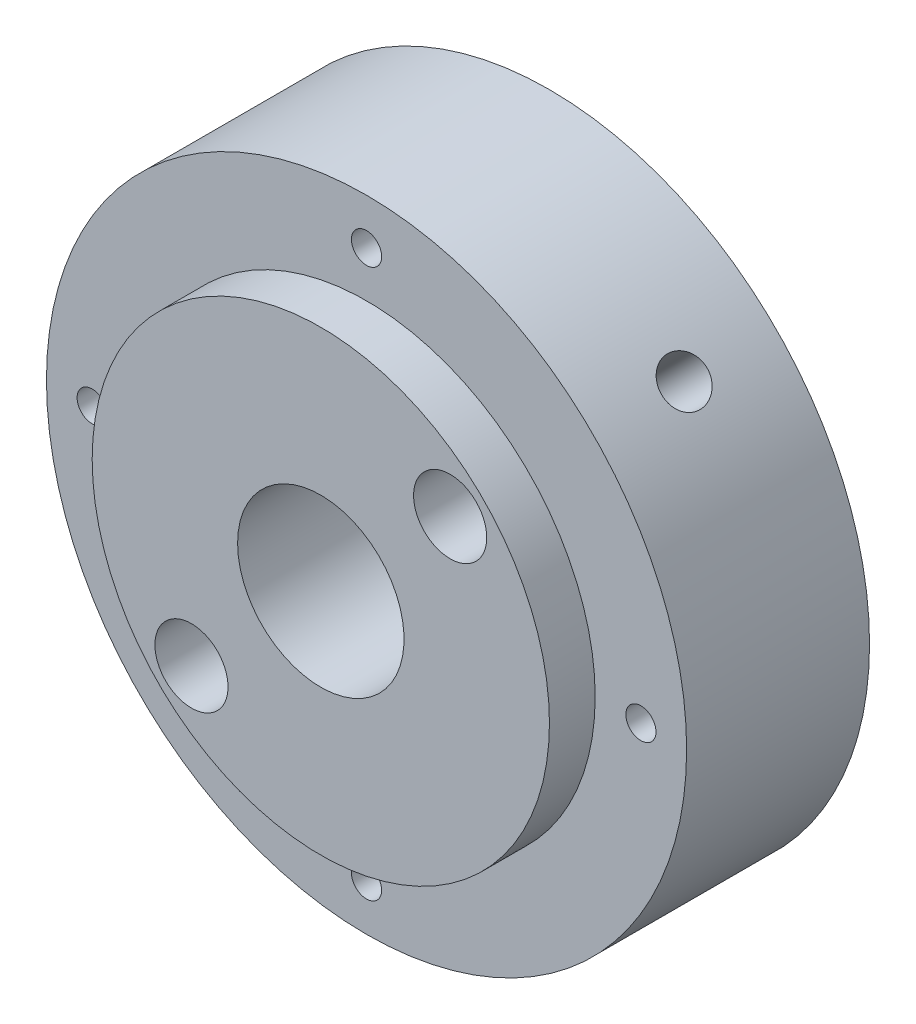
ISO-10303-21;
HEADER;
FILE_DESCRIPTION(('STEP AP214'),'2;1');
FILE_NAME('part.step','',(''),(''),'','','');
FILE_SCHEMA(('AUTOMOTIVE_DESIGN { 1 0 10303 214 1 1 1 1 }'));
ENDSEC;
DATA;
#1=APPLICATION_CONTEXT('core data for automotive mechanical design processes');
#2=APPLICATION_PROTOCOL_DEFINITION('international standard','automotive_design',2000,#1);
#3=PRODUCT_CONTEXT('',#1,'mechanical');
#4=PRODUCT('Part','Part','',(#3));
#5=PRODUCT_RELATED_PRODUCT_CATEGORY('part','',(#4));
#6=PRODUCT_DEFINITION_FORMATION('','',#4);
#7=PRODUCT_DEFINITION_CONTEXT('part definition',#1,'design');
#8=PRODUCT_DEFINITION('design','',#6,#7);
#9=PRODUCT_DEFINITION_SHAPE('','',#8);
#10=(LENGTH_UNIT() NAMED_UNIT(*) SI_UNIT(.MILLI.,.METRE.));
#11=(NAMED_UNIT(*) PLANE_ANGLE_UNIT() SI_UNIT($,.RADIAN.));
#12=(NAMED_UNIT(*) SI_UNIT($,.STERADIAN.) SOLID_ANGLE_UNIT());
#13=UNCERTAINTY_MEASURE_WITH_UNIT(LENGTH_MEASURE(1.E-05),#10,'distance_accuracy_value','');
#14=(GEOMETRIC_REPRESENTATION_CONTEXT(3) GLOBAL_UNCERTAINTY_ASSIGNED_CONTEXT((#13)) GLOBAL_UNIT_ASSIGNED_CONTEXT((#10,
#11,#12)) REPRESENTATION_CONTEXT('',''));
#15=CARTESIAN_POINT('',(0.,0.,0.));
#16=DIRECTION('',(0.,0.,1.));
#17=DIRECTION('',(1.,0.,0.));
#18=AXIS2_PLACEMENT_3D('',#15,#16,#17);
#19=CARTESIAN_POINT('',(1.45519152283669E-11,0.,20.));
#20=DIRECTION('',(0.,0.,1.));
#21=DIRECTION('',(1.,0.,0.));
#22=AXIS2_PLACEMENT_3D('',#19,#20,#21);
#23=PLANE('',#22);
#24=CARTESIAN_POINT('',(-30.,0.,20.));
#25=DIRECTION('',(0.,0.,1.));
#26=DIRECTION('',(1.,0.,0.));
#27=AXIS2_PLACEMENT_3D('',#24,#25,#26);
#28=CIRCLE('',#27,1.65);
#29=CARTESIAN_POINT('',(-28.35,0.,20.));
#30=VERTEX_POINT('',#29);
#31=EDGE_CURVE('E66',#30,#30,#28,.T.);
#32=ORIENTED_EDGE('',*,*,#31,.F.);
#33=EDGE_LOOP('',(#32));
#34=FACE_BOUND('',#33,.T.);
#35=CARTESIAN_POINT('',(3.63797880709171E-12,-30.,20.));
#36=DIRECTION('',(0.,0.,1.));
#37=DIRECTION('',(1.,0.,0.));
#38=AXIS2_PLACEMENT_3D('',#35,#36,#37);
#39=CIRCLE('',#38,1.65);
#40=CARTESIAN_POINT('',(1.65000000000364,-30.,20.));
#41=VERTEX_POINT('',#40);
#42=EDGE_CURVE('E62',#41,#41,#39,.T.);
#43=ORIENTED_EDGE('',*,*,#42,.F.);
#44=EDGE_LOOP('',(#43));
#45=FACE_BOUND('',#44,.T.);
#46=CARTESIAN_POINT('',(30.0000000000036,0.,20.));
#47=DIRECTION('',(0.,0.,1.));
#48=DIRECTION('',(1.,0.,0.));
#49=AXIS2_PLACEMENT_3D('',#46,#47,#48);
#50=CIRCLE('',#49,1.65);
#51=CARTESIAN_POINT('',(31.6500000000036,0.,20.));
#52=VERTEX_POINT('',#51);
#53=EDGE_CURVE('E58',#52,#52,#50,.T.);
#54=ORIENTED_EDGE('',*,*,#53,.F.);
#55=EDGE_LOOP('',(#54));
#56=FACE_BOUND('',#55,.T.);
#57=CARTESIAN_POINT('',(3.63797880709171E-12,29.9999999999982,20.));
#58=DIRECTION('',(0.,0.,1.));
#59=DIRECTION('',(1.,0.,0.));
#60=AXIS2_PLACEMENT_3D('',#57,#58,#59);
#61=CIRCLE('',#60,1.65);
#62=CARTESIAN_POINT('',(1.65000000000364,29.9999999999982,20.));
#63=VERTEX_POINT('',#62);
#64=EDGE_CURVE('E53',#63,#63,#61,.T.);
#65=ORIENTED_EDGE('',*,*,#64,.F.);
#66=EDGE_LOOP('',(#65));
#67=FACE_BOUND('',#66,.T.);
#68=CARTESIAN_POINT('',(1.45519152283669E-11,0.,20.));
#69=DIRECTION('',(0.,0.,1.));
#70=DIRECTION('',(1.,0.,0.));
#71=AXIS2_PLACEMENT_3D('',#68,#69,#70);
#72=CIRCLE('',#71,34.9999999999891);
#73=CARTESIAN_POINT('',(35.0000000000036,0.,20.));
#74=VERTEX_POINT('',#73);
#75=EDGE_CURVE('E10',#74,#74,#72,.T.);
#76=ORIENTED_EDGE('',*,*,#75,.T.);
#77=EDGE_LOOP('',(#76));
#78=FACE_BOUND('',#77,.T.);
#79=CARTESIAN_POINT('',(0.,0.,20.));
#80=DIRECTION('',(0.,0.,1.));
#81=DIRECTION('',(1.,0.,0.));
#82=AXIS2_PLACEMENT_3D('',#79,#80,#81);
#83=CIRCLE('',#82,25.);
#84=CARTESIAN_POINT('',(25.,0.,20.));
#85=VERTEX_POINT('',#84);
#86=EDGE_CURVE('E114',#85,#85,#83,.T.);
#87=ORIENTED_EDGE('',*,*,#86,.F.);
#88=EDGE_LOOP('',(#87));
#89=FACE_BOUND('',#88,.T.);
#90=ADVANCED_FACE('F30',(#34,#45,#56,#67,#78,#89),#23,.T.);
#91=CARTESIAN_POINT('',(1.45519152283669E-11,0.,0.));
#92=DIRECTION('',(0.,0.,1.));
#93=DIRECTION('',(1.,0.,0.));
#94=AXIS2_PLACEMENT_3D('',#91,#92,#93);
#95=PLANE('',#94);
#96=CARTESIAN_POINT('',(-14.1421356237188,-14.1421356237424,0.));
#97=DIRECTION('',(0.,0.,1.));
#98=DIRECTION('',(1.,0.,0.));
#99=AXIS2_PLACEMENT_3D('',#96,#97,#98);
#100=CIRCLE('',#99,4.);
#101=CARTESIAN_POINT('',(-10.1421356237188,-14.1421356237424,0.));
#102=VERTEX_POINT('',#101);
#103=EDGE_CURVE('E122',#102,#102,#100,.T.);
#104=ORIENTED_EDGE('',*,*,#103,.T.);
#105=EDGE_LOOP('',(#104));
#106=FACE_BOUND('',#105,.T.);
#107=CARTESIAN_POINT('',(1.45519152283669E-11,0.,0.));
#108=DIRECTION('',(0.,0.,1.));
#109=DIRECTION('',(1.,0.,0.));
#110=AXIS2_PLACEMENT_3D('',#107,#108,#109);
#111=CIRCLE('',#110,34.9999999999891);
#112=CARTESIAN_POINT('',(35.0000000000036,0.,0.));
#113=VERTEX_POINT('',#112);
#114=EDGE_CURVE('E43',#113,#113,#111,.T.);
#115=ORIENTED_EDGE('',*,*,#114,.F.);
#116=EDGE_LOOP('',(#115));
#117=FACE_BOUND('',#116,.T.);
#118=CARTESIAN_POINT('',(1.45519152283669E-11,0.,0.));
#119=DIRECTION('',(0.,0.,1.));
#120=DIRECTION('',(1.,0.,0.));
#121=AXIS2_PLACEMENT_3D('',#118,#119,#120);
#122=CIRCLE('',#121,9.1);
#123=CARTESIAN_POINT('',(9.10000000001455,0.,0.));
#124=VERTEX_POINT('',#123);
#125=EDGE_CURVE('E48',#124,#124,#122,.T.);
#126=ORIENTED_EDGE('',*,*,#125,.T.);
#127=EDGE_LOOP('',(#126));
#128=FACE_BOUND('',#127,.T.);
#129=CARTESIAN_POINT('',(14.142135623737,14.1421356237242,0.));
#130=DIRECTION('',(0.,0.,1.));
#131=DIRECTION('',(1.,0.,0.));
#132=AXIS2_PLACEMENT_3D('',#129,#130,#131);
#133=CIRCLE('',#132,4.);
#134=CARTESIAN_POINT('',(18.142135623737,14.1421356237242,0.));
#135=VERTEX_POINT('',#134);
#136=EDGE_CURVE('E118',#135,#135,#133,.T.);
#137=ORIENTED_EDGE('',*,*,#136,.T.);
#138=EDGE_LOOP('',(#137));
#139=FACE_BOUND('',#138,.T.);
#140=ADVANCED_FACE('F129',(#106,#117,#128,#139),#95,.F.);
#141=CARTESIAN_POINT('',(1.45519152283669E-11,0.,20.));
#142=DIRECTION('',(0.,0.,-1.));
#143=DIRECTION('',(-1.,0.,0.));
#144=AXIS2_PLACEMENT_3D('',#141,#142,#143);
#145=CYLINDRICAL_SURFACE('',#144,34.9999999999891);
#146=CARTESIAN_POINT('',(22.917755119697,26.4532890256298,10.));
#147=CARTESIAN_POINT('',(22.9177603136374,26.4532855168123,9.85976621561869));
#148=CARTESIAN_POINT('',(22.9267304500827,26.4455215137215,9.71943531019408));
#149=CARTESIAN_POINT('',(22.962334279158,26.4146122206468,9.44265148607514));
#150=CARTESIAN_POINT('',(22.9889883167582,26.3914492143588,9.30620322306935));
#151=CARTESIAN_POINT('',(23.0590401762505,26.3302642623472,9.04123380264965));
#152=CARTESIAN_POINT('',(23.1024289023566,26.2922503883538,8.91270838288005));
#153=CARTESIAN_POINT('',(23.2044768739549,26.2022300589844,8.6671759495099));
#154=CARTESIAN_POINT('',(23.2631327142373,26.150226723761,8.55016637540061));
#155=CARTESIAN_POINT('',(23.3938924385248,26.0333147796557,8.3307298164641));
#156=CARTESIAN_POINT('',(23.4660190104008,25.968384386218,8.22832795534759));
#157=CARTESIAN_POINT('',(23.6213188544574,25.827200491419,8.04122903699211));
#158=CARTESIAN_POINT('',(23.7044925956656,25.7509465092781,7.95653273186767));
#159=CARTESIAN_POINT('',(23.8793411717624,25.5888895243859,7.80716894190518));
#160=CARTESIAN_POINT('',(23.9710248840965,25.5030765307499,7.74252268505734));
#161=CARTESIAN_POINT('',(24.1599725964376,25.3241512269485,7.63522990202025));
#162=CARTESIAN_POINT('',(24.2572365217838,25.2310390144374,7.59258308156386));
#163=CARTESIAN_POINT('',(24.4542317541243,25.0401541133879,7.5305706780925));
#164=CARTESIAN_POINT('',(24.5539585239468,24.9423897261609,7.51116513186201));
#165=CARTESIAN_POINT('',(24.7531175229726,24.744754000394,7.49606266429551));
#166=CARTESIAN_POINT('',(24.8525497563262,24.6448826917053,7.50036540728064));
#167=CARTESIAN_POINT('',(25.0481257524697,24.4460796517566,7.53252453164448));
#168=CARTESIAN_POINT('',(25.1442751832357,24.3471465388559,7.56033793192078));
#169=CARTESIAN_POINT('',(25.3308694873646,24.1529541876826,7.63866209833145));
#170=CARTESIAN_POINT('',(25.4213143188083,24.0576949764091,7.68917303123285));
#171=CARTESIAN_POINT('',(25.5942281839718,23.8736561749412,7.81150681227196));
#172=CARTESIAN_POINT('',(25.6766898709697,23.7848825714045,7.88334904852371));
#173=CARTESIAN_POINT('',(25.8314892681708,23.6166731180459,8.04629200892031));
#174=CARTESIAN_POINT('',(25.9038268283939,23.5372374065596,8.13739301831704));
#175=CARTESIAN_POINT('',(26.0367911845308,23.3900702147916,8.33651005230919));
#176=CARTESIAN_POINT('',(26.0973914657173,23.3223652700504,8.44456339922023));
#177=CARTESIAN_POINT('',(26.2052639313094,23.2010937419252,8.67438738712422));
#178=CARTESIAN_POINT('',(26.2525361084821,23.1475271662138,8.79615803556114));
#179=CARTESIAN_POINT('',(26.332675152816,23.0563206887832,9.04998483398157));
#180=CARTESIAN_POINT('',(26.365540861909,23.0186820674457,9.1820418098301));
#181=CARTESIAN_POINT('',(26.4161186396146,22.960622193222,9.45268107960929));
#182=CARTESIAN_POINT('',(26.4338309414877,22.9402006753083,9.59126327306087));
#183=CARTESIAN_POINT('',(26.4536831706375,22.9173052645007,9.87069152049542));
#184=CARTESIAN_POINT('',(26.4558573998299,22.9147918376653,10.0115318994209));
#185=CARTESIAN_POINT('',(26.4446757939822,22.9276948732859,10.2917665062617));
#186=CARTESIAN_POINT('',(26.4313200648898,22.9431112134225,10.4311607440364));
#187=CARTESIAN_POINT('',(26.3893991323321,22.9913162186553,10.704397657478));
#188=CARTESIAN_POINT('',(26.3608498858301,23.0240866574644,10.8382459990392));
#189=CARTESIAN_POINT('',(26.2891907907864,23.1058734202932,11.096766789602));
#190=CARTESIAN_POINT('',(26.2460807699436,23.1548899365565,11.2214391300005));
#191=CARTESIAN_POINT('',(26.1461872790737,23.267628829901,11.4583083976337));
#192=CARTESIAN_POINT('',(26.0893800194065,23.3313767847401,11.5704831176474));
#193=CARTESIAN_POINT('',(25.9634447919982,23.4714375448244,11.7789489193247));
#194=CARTESIAN_POINT('',(25.8943166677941,23.5477505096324,11.8752397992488));
#195=CARTESIAN_POINT('',(25.7452477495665,23.7106390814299,12.0493816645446));
#196=CARTESIAN_POINT('',(25.6652875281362,23.7972330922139,12.127198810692));
#197=CARTESIAN_POINT('',(25.496632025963,23.9778439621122,12.2619524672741));
#198=CARTESIAN_POINT('',(25.4079368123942,24.0718607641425,12.3188891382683));
#199=CARTESIAN_POINT('',(25.2241894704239,24.264334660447,12.4102070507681));
#200=CARTESIAN_POINT('',(25.129143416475,24.3627874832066,12.4446095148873));
#201=CARTESIAN_POINT('',(24.9351809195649,24.5612702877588,12.4899518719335));
#202=CARTESIAN_POINT('',(24.8362645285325,24.66130024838,12.5008920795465));
#203=CARTESIAN_POINT('',(24.6375587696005,24.8598145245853,12.498996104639));
#204=CARTESIAN_POINT('',(24.5377718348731,24.9583017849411,12.4862127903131));
#205=CARTESIAN_POINT('',(24.3399965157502,25.1512158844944,12.4373425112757));
#206=CARTESIAN_POINT('',(24.2420081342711,25.2456427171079,12.4012555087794));
#207=CARTESIAN_POINT('',(24.0507566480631,25.4279092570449,12.3068148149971));
#208=CARTESIAN_POINT('',(23.9574934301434,25.5157491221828,12.2484616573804));
#209=CARTESIAN_POINT('',(23.7785473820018,25.6825946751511,12.1111517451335));
#210=CARTESIAN_POINT('',(23.6928643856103,25.7616005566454,12.0321954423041));
#211=CARTESIAN_POINT('',(23.5315920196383,25.9089976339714,11.8557232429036));
#212=CARTESIAN_POINT('',(23.4560242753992,25.9773661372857,11.7581686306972));
#213=CARTESIAN_POINT('',(23.3176127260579,26.1016784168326,11.5473306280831));
#214=CARTESIAN_POINT('',(23.2547720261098,26.1576191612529,11.4340434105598));
#215=CARTESIAN_POINT('',(23.1438273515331,26.2558330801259,11.1947914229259));
#216=CARTESIAN_POINT('',(23.0957454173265,26.2980858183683,11.0688080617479));
#217=CARTESIAN_POINT('',(23.0161108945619,26.3678111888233,10.8079645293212));
#218=CARTESIAN_POINT('',(22.9845390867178,26.3953010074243,10.6731148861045));
#219=CARTESIAN_POINT('',(22.9471400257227,26.4278094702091,10.4478762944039));
#220=CARTESIAN_POINT('',(22.9361374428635,26.4373541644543,10.3589405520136));
#221=CARTESIAN_POINT('',(22.9214433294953,26.4500950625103,10.1800165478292));
#222=CARTESIAN_POINT('',(22.917751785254,26.4532912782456,10.0900282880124));
#223=CARTESIAN_POINT('',(22.917755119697,26.4532890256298,10.));
#224=B_SPLINE_CURVE_WITH_KNOTS('',3,(#146,#147,#148,#149,#150,#151,#152,#153,#154,#155,#156,
#157,#158,#159,#160,#161,#162,#163,#164,#165,#166,#167,#168,#169,#170,#171,#172,#173,#174,#175,
#176,#177,#178,#179,#180,#181,#182,#183,#184,#185,#186,#187,#188,#189,#190,#191,#192,#193,#194,
#195,#196,#197,#198,#199,#200,#201,#202,#203,#204,#205,#206,#207,#208,#209,#210,#211,#212,#213,
#214,#215,#216,#217,#218,#219,#220,#221,#222,#223),.UNSPECIFIED.,.T.,.F.,(4,2,2,2,2,2,2,2,2,2,2,
2,2,2,2,2,2,2,2,2,2,2,2,2,2,2,2,2,2,2,2,2,2,2,2,2,2,2,4),(0.,0.420372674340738,
0.841229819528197,1.26185853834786,1.68239351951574,2.10364327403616,2.52491091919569,
2.94662307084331,3.3683295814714,3.78930992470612,4.21028430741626,4.63049074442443,
5.05070026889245,5.47129289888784,5.89189175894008,6.31342995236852,6.73496837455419,
7.15654067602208,7.57810648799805,7.99874136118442,8.41937336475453,8.83956446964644,
9.25976054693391,9.68069175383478,10.101628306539,10.5233300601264,10.9450285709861,
11.3663293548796,11.7876244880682,12.2079818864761,12.6283399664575,13.0486879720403,
13.4690267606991,13.8902503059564,14.311576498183,14.7335288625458,15.1549889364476,
15.4248632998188,15.694737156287),.UNSPECIFIED.);
#225=CARTESIAN_POINT('',(22.917755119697,26.4532890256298,10.));
#226=VERTEX_POINT('',#225);
#227=EDGE_CURVE('E76',#226,#226,#224,.T.);
#228=ORIENTED_EDGE('',*,*,#227,.T.);
#229=EDGE_LOOP('',(#228));
#230=FACE_BOUND('',#229,.T.);
#231=CARTESIAN_POINT('',(-22.9177551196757,-26.4532890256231,10.));
#232=CARTESIAN_POINT('',(-22.9177603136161,-26.4532855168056,9.85976621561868));
#233=CARTESIAN_POINT('',(-22.9267304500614,-26.4455215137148,9.71943531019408));
#234=CARTESIAN_POINT('',(-22.9623342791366,-26.41461222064,9.44265148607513));
#235=CARTESIAN_POINT('',(-22.9889883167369,-26.391449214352,9.30620322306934));
#236=CARTESIAN_POINT('',(-23.0590401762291,-26.3302642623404,9.04123380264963));
#237=CARTESIAN_POINT('',(-23.1024289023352,-26.292250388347,8.91270838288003));
#238=CARTESIAN_POINT('',(-23.2044768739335,-26.2022300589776,8.66717594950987));
#239=CARTESIAN_POINT('',(-23.2631327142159,-26.1502267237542,8.55016637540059));
#240=CARTESIAN_POINT('',(-23.3938924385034,-26.0333147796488,8.33072981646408));
#241=CARTESIAN_POINT('',(-23.4660190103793,-25.968384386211,8.22832795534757));
#242=CARTESIAN_POINT('',(-23.6213188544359,-25.827200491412,8.04122903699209));
#243=CARTESIAN_POINT('',(-23.7044925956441,-25.7509465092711,7.95653273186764));
#244=CARTESIAN_POINT('',(-23.8793411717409,-25.5888895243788,7.80716894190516));
#245=CARTESIAN_POINT('',(-23.9710248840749,-25.5030765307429,7.74252268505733));
#246=CARTESIAN_POINT('',(-24.159972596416,-25.3241512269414,7.63522990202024));
#247=CARTESIAN_POINT('',(-24.2572365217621,-25.2310390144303,7.59258308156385));
#248=CARTESIAN_POINT('',(-24.4542317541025,-25.0401541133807,7.5305706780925));
#249=CARTESIAN_POINT('',(-24.553958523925,-24.9423897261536,7.51116513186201));
#250=CARTESIAN_POINT('',(-24.7531175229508,-24.7447540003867,7.49606266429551));
#251=CARTESIAN_POINT('',(-24.8525497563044,-24.644882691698,7.50036540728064));
#252=CARTESIAN_POINT('',(-25.0481257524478,-24.4460796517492,7.53252453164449));
#253=CARTESIAN_POINT('',(-25.1442751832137,-24.3471465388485,7.56033793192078));
#254=CARTESIAN_POINT('',(-25.3308694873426,-24.1529541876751,7.63866209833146));
#255=CARTESIAN_POINT('',(-25.4213143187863,-24.0576949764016,7.68917303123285));
#256=CARTESIAN_POINT('',(-25.5942281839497,-23.8736561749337,7.81150681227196));
#257=CARTESIAN_POINT('',(-25.6766898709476,-23.7848825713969,7.88334904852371));
#258=CARTESIAN_POINT('',(-25.8314892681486,-23.6166731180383,8.04629200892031));
#259=CARTESIAN_POINT('',(-25.9038268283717,-23.537237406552,8.13739301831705));
#260=CARTESIAN_POINT('',(-26.0367911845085,-23.390070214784,8.33651005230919));
#261=CARTESIAN_POINT('',(-26.0973914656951,-23.3223652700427,8.44456339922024));
#262=CARTESIAN_POINT('',(-26.2052639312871,-23.2010937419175,8.67438738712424));
#263=CARTESIAN_POINT('',(-26.2525361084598,-23.1475271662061,8.79615803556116));
#264=CARTESIAN_POINT('',(-26.3326751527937,-23.0563206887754,9.04998483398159));
#265=CARTESIAN_POINT('',(-26.3655408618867,-23.018682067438,9.18204180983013));
#266=CARTESIAN_POINT('',(-26.4161186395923,-22.9606221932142,9.45268107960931));
#267=CARTESIAN_POINT('',(-26.4338309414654,-22.9402006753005,9.5912632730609));
#268=CARTESIAN_POINT('',(-26.4536831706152,-22.9173052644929,9.87069152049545));
#269=CARTESIAN_POINT('',(-26.4558573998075,-22.9147918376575,10.0115318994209));
#270=CARTESIAN_POINT('',(-26.4446757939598,-22.9276948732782,10.2917665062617));
#271=CARTESIAN_POINT('',(-26.4313200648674,-22.9431112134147,10.4311607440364));
#272=CARTESIAN_POINT('',(-26.3893991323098,-22.9913162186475,10.704397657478));
#273=CARTESIAN_POINT('',(-26.3608498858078,-23.0240866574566,10.8382459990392));
#274=CARTESIAN_POINT('',(-26.2891907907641,-23.1058734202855,11.096766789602));
#275=CARTESIAN_POINT('',(-26.2460807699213,-23.1548899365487,11.2214391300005));
#276=CARTESIAN_POINT('',(-26.1461872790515,-23.2676288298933,11.4583083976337));
#277=CARTESIAN_POINT('',(-26.0893800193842,-23.3313767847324,11.5704831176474));
#278=CARTESIAN_POINT('',(-25.963444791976,-23.4714375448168,11.7789489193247));
#279=CARTESIAN_POINT('',(-25.8943166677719,-23.5477505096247,11.8752397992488));
#280=CARTESIAN_POINT('',(-25.7452477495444,-23.7106390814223,12.0493816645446));
#281=CARTESIAN_POINT('',(-25.6652875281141,-23.7972330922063,12.127198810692));
#282=CARTESIAN_POINT('',(-25.496632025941,-23.9778439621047,12.2619524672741));
#283=CARTESIAN_POINT('',(-25.4079368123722,-24.071860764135,12.3188891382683));
#284=CARTESIAN_POINT('',(-25.2241894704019,-24.2643346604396,12.4102070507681));
#285=CARTESIAN_POINT('',(-25.1291434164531,-24.3627874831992,12.4446095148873));
#286=CARTESIAN_POINT('',(-24.935180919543,-24.5612702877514,12.4899518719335));
#287=CARTESIAN_POINT('',(-24.8362645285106,-24.6613002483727,12.5008920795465));
#288=CARTESIAN_POINT('',(-24.6375587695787,-24.859814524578,12.498996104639));
#289=CARTESIAN_POINT('',(-24.5377718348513,-24.9583017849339,12.4862127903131));
#290=CARTESIAN_POINT('',(-24.3399965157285,-25.1512158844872,12.4373425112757));
#291=CARTESIAN_POINT('',(-24.2420081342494,-25.2456427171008,12.4012555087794));
#292=CARTESIAN_POINT('',(-24.0507566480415,-25.4279092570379,12.3068148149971));
#293=CARTESIAN_POINT('',(-23.9574934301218,-25.5157491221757,12.2484616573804));
#294=CARTESIAN_POINT('',(-23.7785473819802,-25.6825946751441,12.1111517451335));
#295=CARTESIAN_POINT('',(-23.6928643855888,-25.7616005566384,12.0321954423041));
#296=CARTESIAN_POINT('',(-23.5315920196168,-25.9089976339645,11.8557232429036));
#297=CARTESIAN_POINT('',(-23.4560242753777,-25.9773661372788,11.7581686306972));
#298=CARTESIAN_POINT('',(-23.3176127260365,-26.1016784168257,11.5473306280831));
#299=CARTESIAN_POINT('',(-23.2547720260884,-26.1576191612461,11.4340434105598));
#300=CARTESIAN_POINT('',(-23.1438273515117,-26.2558330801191,11.194791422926));
#301=CARTESIAN_POINT('',(-23.0957454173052,-26.2980858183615,11.0688080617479));
#302=CARTESIAN_POINT('',(-23.0161108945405,-26.3678111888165,10.8079645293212));
#303=CARTESIAN_POINT('',(-22.9845390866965,-26.3953010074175,10.6731148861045));
#304=CARTESIAN_POINT('',(-22.9471400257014,-26.4278094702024,10.4478762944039));
#305=CARTESIAN_POINT('',(-22.9361374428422,-26.4373541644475,10.3589405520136));
#306=CARTESIAN_POINT('',(-22.921443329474,-26.4500950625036,10.1800165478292));
#307=CARTESIAN_POINT('',(-22.9177517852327,-26.4532912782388,10.0900282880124));
#308=CARTESIAN_POINT('',(-22.9177551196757,-26.4532890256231,10.));
#309=B_SPLINE_CURVE_WITH_KNOTS('',3,(#231,#232,#233,#234,#235,#236,#237,#238,#239,#240,#241,
#242,#243,#244,#245,#246,#247,#248,#249,#250,#251,#252,#253,#254,#255,#256,#257,#258,#259,#260,
#261,#262,#263,#264,#265,#266,#267,#268,#269,#270,#271,#272,#273,#274,#275,#276,#277,#278,#279,
#280,#281,#282,#283,#284,#285,#286,#287,#288,#289,#290,#291,#292,#293,#294,#295,#296,#297,#298,
#299,#300,#301,#302,#303,#304,#305,#306,#307,#308),.UNSPECIFIED.,.T.,.F.,(4,2,2,2,2,2,2,2,2,2,2,
2,2,2,2,2,2,2,2,2,2,2,2,2,2,2,2,2,2,2,2,2,2,2,2,2,2,2,4),(0.,0.420372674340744,0.84122981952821,
1.26185853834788,1.68239351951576,2.10364327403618,2.52491091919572,2.94662307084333,
3.36832958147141,3.78930992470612,4.21028430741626,4.63049074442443,5.05070026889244,
5.47129289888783,5.89189175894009,6.31342995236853,6.73496837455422,7.15654067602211,
7.57810648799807,7.99874136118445,8.41937336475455,8.83956446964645,9.25976054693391,
9.68069175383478,10.101628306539,10.5233300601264,10.9450285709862,11.3663293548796,
11.7876244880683,12.2079818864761,12.6283399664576,13.0486879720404,13.4690267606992,
13.8902503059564,14.311576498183,14.7335288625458,15.1549889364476,15.4248632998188,
15.694737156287),.UNSPECIFIED.);
#310=CARTESIAN_POINT('',(-22.9177551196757,-26.4532890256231,10.));
#311=VERTEX_POINT('',#310);
#312=EDGE_CURVE('E75',#311,#311,#309,.T.);
#313=ORIENTED_EDGE('',*,*,#312,.T.);
#314=EDGE_LOOP('',(#313));
#315=FACE_BOUND('',#314,.T.);
#316=ORIENTED_EDGE('',*,*,#75,.F.);
#317=EDGE_LOOP('',(#316));
#318=FACE_BOUND('',#317,.T.);
#319=ORIENTED_EDGE('',*,*,#114,.T.);
#320=EDGE_LOOP('',(#319));
#321=FACE_BOUND('',#320,.T.);
#322=ADVANCED_FACE('F32',(#230,#315,#318,#321),#145,.T.);
#323=CARTESIAN_POINT('',(1.45519152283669E-11,0.,20.));
#324=DIRECTION('',(0.,0.,-1.));
#325=DIRECTION('',(-1.,0.,0.));
#326=AXIS2_PLACEMENT_3D('',#323,#324,#325);
#327=CYLINDRICAL_SURFACE('',#326,9.1);
#328=ORIENTED_EDGE('',*,*,#125,.F.);
#329=EDGE_LOOP('',(#328));
#330=FACE_BOUND('',#329,.T.);
#331=CARTESIAN_POINT('',(0.,0.,25.));
#332=DIRECTION('',(0.,0.,-1.));
#333=DIRECTION('',(-1.,0.,0.));
#334=AXIS2_PLACEMENT_3D('',#331,#332,#333);
#335=CIRCLE('',#334,9.10000000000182);
#336=CARTESIAN_POINT('',(-9.10000000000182,0.,25.));
#337=VERTEX_POINT('',#336);
#338=EDGE_CURVE('E111',#337,#337,#335,.T.);
#339=ORIENTED_EDGE('',*,*,#338,.F.);
#340=EDGE_LOOP('',(#339));
#341=FACE_BOUND('',#340,.T.);
#342=ADVANCED_FACE('F132',(#330,#341),#327,.F.);
#343=CARTESIAN_POINT('',(-14.1421356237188,-14.1421356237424,20.));
#344=DIRECTION('',(0.,0.,-1.));
#345=DIRECTION('',(-1.,0.,0.));
#346=AXIS2_PLACEMENT_3D('',#343,#344,#345);
#347=CYLINDRICAL_SURFACE('',#346,4.);
#348=CARTESIAN_POINT('',(-14.5823088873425,-18.1178427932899,10.));
#349=CARTESIAN_POINT('',(-14.5823099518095,-18.1178430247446,9.93784324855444));
#350=CARTESIAN_POINT('',(-14.5852717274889,-18.1175187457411,9.87567405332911));
#351=CARTESIAN_POINT('',(-14.5970143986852,-18.1161908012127,9.75188282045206));
#352=CARTESIAN_POINT('',(-14.6057987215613,-18.1151867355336,9.69026112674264));
#353=CARTESIAN_POINT('',(-14.6405847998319,-18.1110308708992,9.50677395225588));
#354=CARTESIAN_POINT('',(-14.6750186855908,-18.1067350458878,9.38645166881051));
#355=CARTESIAN_POINT('',(-14.7624348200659,-18.0939856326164,9.15440180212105));
#356=CARTESIAN_POINT('',(-14.8152561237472,-18.0855678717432,9.04260958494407));
#357=CARTESIAN_POINT('',(-14.9356655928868,-18.0631128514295,8.82799147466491));
#358=CARTESIAN_POINT('',(-15.0032541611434,-18.0490754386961,8.72516582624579));
#359=CARTESIAN_POINT('',(-15.1597439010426,-18.0114727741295,8.5162660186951));
#360=CARTESIAN_POINT('',(-15.250287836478,-17.9868819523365,8.41160667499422));
#361=CARTESIAN_POINT('',(-15.4421017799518,-17.9263450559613,8.21623844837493));
#362=CARTESIAN_POINT('',(-15.5433810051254,-17.890389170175,8.1255417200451));
#363=CARTESIAN_POINT('',(-15.7658333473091,-17.7999531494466,7.94977970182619));
#364=CARTESIAN_POINT('',(-15.8879324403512,-17.7437615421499,7.86671381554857));
#365=CARTESIAN_POINT('',(-16.0735543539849,-17.6456421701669,7.75945484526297));
#366=CARTESIAN_POINT('',(-16.1358588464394,-17.6106182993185,7.72658486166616));
#367=CARTESIAN_POINT('',(-16.2605890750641,-17.5358685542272,7.66704531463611));
#368=CARTESIAN_POINT('',(-16.3230146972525,-17.4961459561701,7.64037146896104));
#369=CARTESIAN_POINT('',(-16.440916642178,-17.4163001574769,7.5960161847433));
#370=CARTESIAN_POINT('',(-16.4964571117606,-17.3766240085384,7.57769802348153));
#371=CARTESIAN_POINT('',(-16.6063778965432,-17.2936822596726,7.54669771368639));
#372=CARTESIAN_POINT('',(-16.6607588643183,-17.2504187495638,7.53401231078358));
#373=CARTESIAN_POINT('',(-16.7677569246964,-17.1605765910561,7.51448620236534));
#374=CARTESIAN_POINT('',(-16.8203750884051,-17.1140000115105,7.50764188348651));
#375=CARTESIAN_POINT('',(-16.9232925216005,-17.0179195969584,7.49990078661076));
#376=CARTESIAN_POINT('',(-16.9735920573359,-16.9684160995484,7.49900332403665));
#377=CARTESIAN_POINT('',(-17.1070979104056,-16.8298482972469,7.5047253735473));
#378=CARTESIAN_POINT('',(-17.1875400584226,-16.7382700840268,7.51730650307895));
#379=CARTESIAN_POINT('',(-17.3379369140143,-16.5507340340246,7.55973021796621));
#380=CARTESIAN_POINT('',(-17.4078908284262,-16.4547758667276,7.58957410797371));
#381=CARTESIAN_POINT('',(-17.5366255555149,-16.2613273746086,7.66520855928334));
#382=CARTESIAN_POINT('',(-17.5953771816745,-16.1638337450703,7.71103991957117));
#383=CARTESIAN_POINT('',(-17.7015365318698,-15.9704823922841,7.81693723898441));
#384=CARTESIAN_POINT('',(-17.7489416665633,-15.8746250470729,7.87700644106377));
#385=CARTESIAN_POINT('',(-17.8383884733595,-15.6754527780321,8.01805641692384));
#386=CARTESIAN_POINT('',(-17.8790285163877,-15.5726943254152,8.10070927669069));
#387=CARTESIAN_POINT('',(-17.9485668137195,-15.3758332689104,8.28026473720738));
#388=CARTESIAN_POINT('',(-17.9774477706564,-15.2817435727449,8.37718804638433));
#389=CARTESIAN_POINT('',(-18.0284918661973,-15.094410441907,8.59741125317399));
#390=CARTESIAN_POINT('',(-18.0492852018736,-15.0028820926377,8.72250276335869));
#391=CARTESIAN_POINT('',(-18.0812902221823,-14.8420014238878,8.98729223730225));
#392=CARTESIAN_POINT('',(-18.0925196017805,-14.7726082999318,9.12696268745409));
#393=CARTESIAN_POINT('',(-18.1063239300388,-14.6777451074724,9.37953880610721));
#394=CARTESIAN_POINT('',(-18.1103983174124,-14.6455229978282,9.48982192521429));
#395=CARTESIAN_POINT('',(-18.1159245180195,-14.5999019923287,9.71423037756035));
#396=CARTESIAN_POINT('',(-18.1173799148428,-14.5864773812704,9.82835024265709));
#397=CARTESIAN_POINT('',(-18.1181216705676,-14.5798007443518,10.0574573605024));
#398=CARTESIAN_POINT('',(-18.1174030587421,-14.5865949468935,10.1724460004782));
#399=CARTESIAN_POINT('',(-18.1135552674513,-14.6197199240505,10.3995611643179));
#400=CARTESIAN_POINT('',(-18.1104240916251,-14.6460668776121,10.5116852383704));
#401=CARTESIAN_POINT('',(-18.1010143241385,-14.715247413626,10.7284367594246));
#402=CARTESIAN_POINT('',(-18.0947884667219,-14.7578020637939,10.8331573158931));
#403=CARTESIAN_POINT('',(-18.0781468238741,-14.856499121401,11.0355746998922));
#404=CARTESIAN_POINT('',(-18.0677295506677,-14.9126463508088,11.1332690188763));
#405=CARTESIAN_POINT('',(-18.0390378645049,-15.0475406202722,11.3386119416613));
#406=CARTESIAN_POINT('',(-18.0196451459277,-15.1285551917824,11.4446145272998));
#407=CARTESIAN_POINT('',(-17.9713013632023,-15.3021448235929,11.6443706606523));
#408=CARTESIAN_POINT('',(-17.9423403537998,-15.3947318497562,11.7381113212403));
#409=CARTESIAN_POINT('',(-17.8674792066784,-15.6036495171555,11.9259640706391));
#410=CARTESIAN_POINT('',(-17.8196080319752,-15.7214072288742,12.0177273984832));
#411=CARTESIAN_POINT('',(-17.7061359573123,-15.9630217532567,12.1801470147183));
#412=CARTESIAN_POINT('',(-17.6405433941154,-16.0868756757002,12.2508131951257));
#413=CARTESIAN_POINT('',(-17.5304643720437,-16.2690837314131,12.336581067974));
#414=CARTESIAN_POINT('',(-17.4931774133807,-16.3274154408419,12.3612974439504));
#415=CARTESIAN_POINT('',(-17.4145460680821,-16.4434893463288,12.4049382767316));
#416=CARTESIAN_POINT('',(-17.3732040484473,-16.5012318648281,12.4238660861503));
#417=CARTESIAN_POINT('',(-17.2866566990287,-16.6154154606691,12.4556058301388));
#418=CARTESIAN_POINT('',(-17.2414547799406,-16.6718576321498,12.4684230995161));
#419=CARTESIAN_POINT('',(-17.1474974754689,-16.7827975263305,12.4877391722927));
#420=CARTESIAN_POINT('',(-17.0987426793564,-16.8372955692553,12.4942390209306));
#421=CARTESIAN_POINT('',(-16.9626466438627,-16.9811873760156,12.5030715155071));
#422=CARTESIAN_POINT('',(-16.8722664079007,-17.068190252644,12.4992657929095));
#423=CARTESIAN_POINT('',(-16.6853417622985,-17.2320528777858,12.4730824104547));
#424=CARTESIAN_POINT('',(-16.5887976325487,-17.3089130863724,12.4507055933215));
#425=CARTESIAN_POINT('',(-16.396279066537,-17.4485679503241,12.3896775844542));
#426=CARTESIAN_POINT('',(-16.3004010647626,-17.511758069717,12.3516179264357));
#427=CARTESIAN_POINT('',(-16.10893147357,-17.6269912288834,12.260880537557));
#428=CARTESIAN_POINT('',(-16.0133399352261,-17.6790323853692,12.2082003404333));
#429=CARTESIAN_POINT('',(-15.815287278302,-17.7772441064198,12.0836787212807));
#430=CARTESIAN_POINT('',(-15.7131429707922,-17.8222446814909,12.0104160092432));
#431=CARTESIAN_POINT('',(-15.5155063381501,-17.9004832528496,11.8498467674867));
#432=CARTESIAN_POINT('',(-15.420021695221,-17.9337078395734,11.7625243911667));
#433=CARTESIAN_POINT('',(-15.2258199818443,-17.9940683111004,11.5617674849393));
#434=CARTESIAN_POINT('',(-15.1286208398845,-18.019636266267,11.4463833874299));
#435=CARTESIAN_POINT('',(-14.9524446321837,-18.0602446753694,11.2007105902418));
#436=CARTESIAN_POINT('',(-14.8734574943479,-18.0752909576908,11.0704301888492));
#437=CARTESIAN_POINT('',(-14.7549236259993,-18.0952710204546,10.8271946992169));
#438=CARTESIAN_POINT('',(-14.7105234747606,-18.1017009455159,10.7167294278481));
#439=CARTESIAN_POINT('',(-14.6403117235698,-18.1111541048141,10.4900606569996));
#440=CARTESIAN_POINT('',(-14.6144412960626,-18.1141881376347,10.3738765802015));
#441=CARTESIAN_POINT('',(-14.5935031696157,-18.1165898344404,10.2139400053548));
#442=CARTESIAN_POINT('',(-14.5893139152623,-18.1170616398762,10.1712744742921));
#443=CARTESIAN_POINT('',(-14.5837160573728,-18.1176880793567,10.0857413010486));
#444=CARTESIAN_POINT('',(-14.5823081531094,-18.1178426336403,10.0428736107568));
#445=CARTESIAN_POINT('',(-14.5823088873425,-18.1178427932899,10.));
#446=B_SPLINE_CURVE_WITH_KNOTS('',3,(#348,#349,#350,#351,#352,#353,#354,#355,#356,#357,#358,
#359,#360,#361,#362,#363,#364,#365,#366,#367,#368,#369,#370,#371,#372,#373,#374,#375,#376,#377,
#378,#379,#380,#381,#382,#383,#384,#385,#386,#387,#388,#389,#390,#391,#392,#393,#394,#395,#396,
#397,#398,#399,#400,#401,#402,#403,#404,#405,#406,#407,#408,#409,#410,#411,#412,#413,#414,#415,
#416,#417,#418,#419,#420,#421,#422,#423,#424,#425,#426,#427,#428,#429,#430,#431,#432,#433,#434,
#435,#436,#437,#438,#439,#440,#441,#442,#443,#444,#445),.UNSPECIFIED.,.T.,.F.,(4,2,2,2,2,2,2,2,
2,2,2,2,2,2,2,2,2,2,2,2,2,2,2,2,2,2,2,2,2,2,2,2,2,2,2,2,2,2,2,2,2,2,2,2,2,2,2,2,4),(0.,
0.186415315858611,0.372940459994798,0.746478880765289,1.11682668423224,1.48718459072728,
1.90722798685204,2.32763499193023,2.79876029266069,3.03445880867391,3.26999394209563,
3.48170145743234,3.69328649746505,3.90474055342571,4.11617026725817,4.48184709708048,
4.84755156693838,5.21419620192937,5.58092442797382,5.9932908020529,6.40626158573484,
6.87316206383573,7.33919680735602,7.68265621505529,8.0256453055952,8.36941921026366,
8.71347788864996,9.05186495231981,9.39037223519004,9.79332737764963,10.1967026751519,
10.6647326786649,11.1325428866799,11.3527929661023,11.5729152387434,11.7928449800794,
12.0127383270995,12.3871595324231,12.7615637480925,13.1229788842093,13.4844550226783,
13.8834503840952,14.2828986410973,14.7399238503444,15.1966956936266,15.5530255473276,
15.9082190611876,16.0367696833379,16.1653526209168),.UNSPECIFIED.);
#447=CARTESIAN_POINT('',(-14.5823088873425,-18.1178427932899,10.));
#448=VERTEX_POINT('',#447);
#449=EDGE_CURVE('E69',#448,#448,#446,.T.);
#450=ORIENTED_EDGE('',*,*,#449,.F.);
#451=EDGE_LOOP('',(#450));
#452=FACE_BOUND('',#451,.T.);
#453=ORIENTED_EDGE('',*,*,#103,.F.);
#454=EDGE_LOOP('',(#453));
#455=FACE_BOUND('',#454,.T.);
#456=CARTESIAN_POINT('',(-14.1421356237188,-14.1421356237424,25.));
#457=DIRECTION('',(0.,0.,-1.));
#458=DIRECTION('',(-1.,0.,0.));
#459=AXIS2_PLACEMENT_3D('',#456,#457,#458);
#460=CIRCLE('',#459,4.);
#461=CARTESIAN_POINT('',(-18.1421356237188,-14.1421356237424,25.));
#462=VERTEX_POINT('',#461);
#463=EDGE_CURVE('E56',#462,#462,#460,.T.);
#464=ORIENTED_EDGE('',*,*,#463,.F.);
#465=EDGE_LOOP('',(#464));
#466=FACE_BOUND('',#465,.T.);
#467=ADVANCED_FACE('F77',(#452,#455,#466),#347,.F.);
#468=CARTESIAN_POINT('',(14.142135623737,14.1421356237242,20.));
#469=DIRECTION('',(0.,0.,-1.));
#470=DIRECTION('',(-1.,0.,0.));
#471=AXIS2_PLACEMENT_3D('',#468,#469,#470);
#472=CYLINDRICAL_SURFACE('',#471,4.);
#473=CARTESIAN_POINT('',(14.5823088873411,18.1178427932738,10.));
#474=CARTESIAN_POINT('',(14.582309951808,18.1178430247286,9.93784324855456));
#475=CARTESIAN_POINT('',(14.5852717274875,18.1175187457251,9.87567405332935));
#476=CARTESIAN_POINT('',(14.5970143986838,18.1161908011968,9.75188282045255));
#477=CARTESIAN_POINT('',(14.6057987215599,18.1151867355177,9.69026112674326));
#478=CARTESIAN_POINT('',(14.6405847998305,18.1110308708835,9.50677395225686));
#479=CARTESIAN_POINT('',(14.6750186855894,18.1067350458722,9.38645166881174));
#480=CARTESIAN_POINT('',(14.7624348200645,18.0939856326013,9.15440180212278));
#481=CARTESIAN_POINT('',(14.8152561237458,18.0855678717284,9.04260958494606));
#482=CARTESIAN_POINT('',(14.9356655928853,18.0631128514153,8.82799147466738));
#483=CARTESIAN_POINT('',(15.0032541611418,18.0490754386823,8.72516582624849));
#484=CARTESIAN_POINT('',(15.1597439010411,18.0114727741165,8.51626601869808));
#485=CARTESIAN_POINT('',(15.2502878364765,17.986881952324,8.41160667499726));
#486=CARTESIAN_POINT('',(15.4421017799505,17.9263450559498,8.21623844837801));
#487=CARTESIAN_POINT('',(15.5433810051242,17.890389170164,8.12554172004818));
#488=CARTESIAN_POINT('',(15.7658333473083,17.7999531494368,7.94977970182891));
#489=CARTESIAN_POINT('',(15.887932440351,17.7437615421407,7.86671381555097));
#490=CARTESIAN_POINT('',(16.0735543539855,17.6456421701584,7.75945484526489));
#491=CARTESIAN_POINT('',(16.1358588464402,17.6106182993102,7.72658486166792));
#492=CARTESIAN_POINT('',(16.2605890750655,17.5358685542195,7.66704531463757));
#493=CARTESIAN_POINT('',(16.3230146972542,17.4961459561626,7.64037146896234));
#494=CARTESIAN_POINT('',(16.4409166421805,17.4163001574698,7.59601618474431));
#495=CARTESIAN_POINT('',(16.4964571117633,17.3766240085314,7.5776980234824));
#496=CARTESIAN_POINT('',(16.6063778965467,17.2936822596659,7.546697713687));
#497=CARTESIAN_POINT('',(16.6607588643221,17.2504187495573,7.53401231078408));
#498=CARTESIAN_POINT('',(16.7677569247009,17.1605765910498,7.51448620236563));
#499=CARTESIAN_POINT('',(16.82037508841,17.1140000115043,7.50764188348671));
#500=CARTESIAN_POINT('',(16.9232925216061,17.0179195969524,7.49990078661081));
#501=CARTESIAN_POINT('',(16.9735920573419,16.9684160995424,7.49900332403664));
#502=CARTESIAN_POINT('',(17.1070979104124,16.8298482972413,7.50472537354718));
#503=CARTESIAN_POINT('',(17.1875400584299,16.7382700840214,7.51730650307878));
#504=CARTESIAN_POINT('',(17.3379369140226,16.5507340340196,7.55973021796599));
#505=CARTESIAN_POINT('',(17.4078908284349,16.4547758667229,7.58957410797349));
#506=CARTESIAN_POINT('',(17.5366255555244,16.2613273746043,7.66520855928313));
#507=CARTESIAN_POINT('',(17.5953771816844,16.1638337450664,7.71103991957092));
#508=CARTESIAN_POINT('',(17.7015365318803,15.9704823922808,7.81693723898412));
#509=CARTESIAN_POINT('',(17.7489416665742,15.8746250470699,7.87700644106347));
#510=CARTESIAN_POINT('',(17.8383884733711,15.6754527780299,8.01805641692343));
#511=CARTESIAN_POINT('',(17.8790285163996,15.5726943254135,8.10070927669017));
#512=CARTESIAN_POINT('',(17.9485668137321,15.3758332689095,8.28026473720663));
#513=CARTESIAN_POINT('',(17.9774477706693,15.2817435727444,8.37718804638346));
#514=CARTESIAN_POINT('',(18.0284918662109,15.0944104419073,8.59741125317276));
#515=CARTESIAN_POINT('',(18.0492852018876,15.0028820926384,8.72250276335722));
#516=CARTESIAN_POINT('',(18.081290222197,14.8420014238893,8.98729223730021));
#517=CARTESIAN_POINT('',(18.0925196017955,14.7726082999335,9.12696268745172));
#518=CARTESIAN_POINT('',(18.1063239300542,14.6777451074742,9.37953880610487));
#519=CARTESIAN_POINT('',(18.110398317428,14.6455229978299,9.48982192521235));
#520=CARTESIAN_POINT('',(18.1159245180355,14.5999019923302,9.71423037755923));
#521=CARTESIAN_POINT('',(18.1173799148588,14.5864773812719,9.8283502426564));
#522=CARTESIAN_POINT('',(18.1181216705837,14.5798007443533,10.0574573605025));
#523=CARTESIAN_POINT('',(18.1174030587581,14.586594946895,10.1724460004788));
#524=CARTESIAN_POINT('',(18.1135552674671,14.6197199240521,10.3995611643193));
#525=CARTESIAN_POINT('',(18.1104240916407,14.6460668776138,10.5116852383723));
#526=CARTESIAN_POINT('',(18.1010143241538,14.7152474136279,10.7284367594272));
#527=CARTESIAN_POINT('',(18.094788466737,14.7578020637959,10.8331573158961));
#528=CARTESIAN_POINT('',(18.0781468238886,14.8564991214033,11.035574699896));
#529=CARTESIAN_POINT('',(18.0677295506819,14.9126463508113,11.1332690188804));
#530=CARTESIAN_POINT('',(18.0390378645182,15.047540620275,11.3386119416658));
#531=CARTESIAN_POINT('',(18.0196451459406,15.1285551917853,11.4446145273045));
#532=CARTESIAN_POINT('',(17.9713013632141,15.302144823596,11.6443706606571));
#533=CARTESIAN_POINT('',(17.942340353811,15.3947318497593,11.7381113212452));
#534=CARTESIAN_POINT('',(17.8674792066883,15.6036495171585,11.9259640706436));
#535=CARTESIAN_POINT('',(17.8196080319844,15.7214072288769,12.0177273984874));
#536=CARTESIAN_POINT('',(17.7061359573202,15.9630217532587,12.1801470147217));
#537=CARTESIAN_POINT('',(17.6405433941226,16.0868756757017,12.2508131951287));
#538=CARTESIAN_POINT('',(17.5304643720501,16.2690837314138,12.3365810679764));
#539=CARTESIAN_POINT('',(17.4931774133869,16.3274154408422,12.3612974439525));
#540=CARTESIAN_POINT('',(17.4145460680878,16.4434893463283,12.4049382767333));
#541=CARTESIAN_POINT('',(17.3732040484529,16.5012318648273,12.4238660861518));
#542=CARTESIAN_POINT('',(17.2866566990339,16.6154154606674,12.4556058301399));
#543=CARTESIAN_POINT('',(17.2414547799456,16.6718576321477,12.4684230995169));
#544=CARTESIAN_POINT('',(17.1474974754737,16.7827975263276,12.4877391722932));
#545=CARTESIAN_POINT('',(17.0987426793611,16.8372955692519,12.494239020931));
#546=CARTESIAN_POINT('',(16.962646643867,16.9811873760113,12.5030715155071));
#547=CARTESIAN_POINT('',(16.8722664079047,17.068190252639,12.4992657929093));
#548=CARTESIAN_POINT('',(16.6853417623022,17.2320528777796,12.4730824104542));
#549=CARTESIAN_POINT('',(16.5887976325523,17.3089130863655,12.4507055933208));
#550=CARTESIAN_POINT('',(16.39627906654,17.4485679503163,12.3896775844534));
#551=CARTESIAN_POINT('',(16.3004010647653,17.5117580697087,12.3516179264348));
#552=CARTESIAN_POINT('',(16.1089314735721,17.6269912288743,12.2608805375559));
#553=CARTESIAN_POINT('',(16.0133399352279,17.6790323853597,12.2082003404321));
#554=CARTESIAN_POINT('',(15.8152872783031,17.7772441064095,12.0836787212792));
#555=CARTESIAN_POINT('',(15.7131429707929,17.8222446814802,12.0104160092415));
#556=CARTESIAN_POINT('',(15.5155063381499,17.9004832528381,11.8498467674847));
#557=CARTESIAN_POINT('',(15.4200216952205,17.9337078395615,11.7625243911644));
#558=CARTESIAN_POINT('',(15.225819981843,17.9940683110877,11.5617674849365));
#559=CARTESIAN_POINT('',(15.1286208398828,18.0196362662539,11.4463833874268));
#560=CARTESIAN_POINT('',(14.9524446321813,18.0602446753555,11.200710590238));
#561=CARTESIAN_POINT('',(14.8734574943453,18.0752909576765,11.070430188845));
#562=CARTESIAN_POINT('',(14.7549236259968,18.0952710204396,10.8271946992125));
#563=CARTESIAN_POINT('',(14.7105234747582,18.1017009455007,10.7167294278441));
#564=CARTESIAN_POINT('',(14.6403117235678,18.1111541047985,10.4900606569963));
#565=CARTESIAN_POINT('',(14.6144412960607,18.1141881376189,10.3738765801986));
#566=CARTESIAN_POINT('',(14.5935031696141,18.1165898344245,10.2139400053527));
#567=CARTESIAN_POINT('',(14.5893139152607,18.1170616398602,10.1712744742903));
#568=CARTESIAN_POINT('',(14.5837160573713,18.1176880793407,10.0857413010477));
#569=CARTESIAN_POINT('',(14.582308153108,18.1178426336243,10.0428736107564));
#570=CARTESIAN_POINT('',(14.5823088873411,18.1178427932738,10.));
#571=B_SPLINE_CURVE_WITH_KNOTS('',3,(#473,#474,#475,#476,#477,#478,#479,#480,#481,#482,#483,
#484,#485,#486,#487,#488,#489,#490,#491,#492,#493,#494,#495,#496,#497,#498,#499,#500,#501,#502,
#503,#504,#505,#506,#507,#508,#509,#510,#511,#512,#513,#514,#515,#516,#517,#518,#519,#520,#521,
#522,#523,#524,#525,#526,#527,#528,#529,#530,#531,#532,#533,#534,#535,#536,#537,#538,#539,#540,
#541,#542,#543,#544,#545,#546,#547,#548,#549,#550,#551,#552,#553,#554,#555,#556,#557,#558,#559,
#560,#561,#562,#563,#564,#565,#566,#567,#568,#569,#570),.UNSPECIFIED.,.T.,.F.,(4,2,2,2,2,2,2,2,
2,2,2,2,2,2,2,2,2,2,2,2,2,2,2,2,2,2,2,2,2,2,2,2,2,2,2,2,2,2,2,2,2,2,2,2,2,2,2,2,4),(0.,
0.186415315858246,0.372940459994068,0.746478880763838,1.11682668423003,1.48718459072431,
1.90722798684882,2.32763499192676,2.7987602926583,3.03445880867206,3.26999394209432,
3.48170145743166,3.69328649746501,3.90474055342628,4.11617026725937,4.48184709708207,
4.84755156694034,5.21419620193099,5.58092442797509,5.99329080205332,6.40626158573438,
6.87316206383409,7.33919680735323,7.68265621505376,8.02564530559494,8.36941921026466,
8.71347788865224,9.05186495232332,9.39037223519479,9.79332737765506,10.196702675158,
10.6647326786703,11.1325428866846,11.3527929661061,11.5729152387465,11.7928449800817,
12.0127383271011,12.3871595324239,12.7615637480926,13.1229788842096,13.4844550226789,
13.8834503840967,14.2828986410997,14.7399238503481,15.1966956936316,15.5530255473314,
15.9082190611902,16.0367696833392,16.1653526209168),.UNSPECIFIED.);
#572=CARTESIAN_POINT('',(14.5823088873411,18.1178427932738,10.));
#573=VERTEX_POINT('',#572);
#574=EDGE_CURVE('E35',#573,#573,#571,.T.);
#575=ORIENTED_EDGE('',*,*,#574,.F.);
#576=EDGE_LOOP('',(#575));
#577=FACE_BOUND('',#576,.T.);
#578=ORIENTED_EDGE('',*,*,#136,.F.);
#579=EDGE_LOOP('',(#578));
#580=FACE_BOUND('',#579,.T.);
#581=CARTESIAN_POINT('',(14.142135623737,14.1421356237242,25.));
#582=DIRECTION('',(0.,0.,-1.));
#583=DIRECTION('',(-1.,0.,0.));
#584=AXIS2_PLACEMENT_3D('',#581,#582,#583);
#585=CIRCLE('',#584,4.);
#586=CARTESIAN_POINT('',(10.142135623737,14.1421356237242,25.));
#587=VERTEX_POINT('',#586);
#588=EDGE_CURVE('E108',#587,#587,#585,.T.);
#589=ORIENTED_EDGE('',*,*,#588,.F.);
#590=EDGE_LOOP('',(#589));
#591=FACE_BOUND('',#590,.T.);
#592=ADVANCED_FACE('F148',(#577,#580,#591),#472,.F.);
#593=CARTESIAN_POINT('',(0.,0.,25.));
#594=DIRECTION('',(0.,0.,-1.));
#595=DIRECTION('',(-1.,0.,0.));
#596=AXIS2_PLACEMENT_3D('',#593,#594,#595);
#597=CYLINDRICAL_SURFACE('',#596,25.);
#598=CARTESIAN_POINT('',(0.,0.,25.));
#599=DIRECTION('',(0.,0.,1.));
#600=DIRECTION('',(1.,0.,0.));
#601=AXIS2_PLACEMENT_3D('',#598,#599,#600);
#602=CIRCLE('',#601,25.);
#603=CARTESIAN_POINT('',(25.,0.,25.));
#604=VERTEX_POINT('',#603);
#605=EDGE_CURVE('E115',#604,#604,#602,.T.);
#606=ORIENTED_EDGE('',*,*,#605,.F.);
#607=EDGE_LOOP('',(#606));
#608=FACE_BOUND('',#607,.T.);
#609=ORIENTED_EDGE('',*,*,#86,.T.);
#610=EDGE_LOOP('',(#609));
#611=FACE_BOUND('',#610,.T.);
#612=ADVANCED_FACE('F141',(#608,#611),#597,.T.);
#613=CARTESIAN_POINT('',(0.,0.,25.));
#614=DIRECTION('',(0.,0.,1.));
#615=DIRECTION('',(1.,0.,0.));
#616=AXIS2_PLACEMENT_3D('',#613,#614,#615);
#617=PLANE('',#616);
#618=ORIENTED_EDGE('',*,*,#463,.T.);
#619=EDGE_LOOP('',(#618));
#620=FACE_BOUND('',#619,.T.);
#621=ORIENTED_EDGE('',*,*,#588,.T.);
#622=EDGE_LOOP('',(#621));
#623=FACE_BOUND('',#622,.T.);
#624=ORIENTED_EDGE('',*,*,#338,.T.);
#625=EDGE_LOOP('',(#624));
#626=FACE_BOUND('',#625,.T.);
#627=ORIENTED_EDGE('',*,*,#605,.T.);
#628=EDGE_LOOP('',(#627));
#629=FACE_BOUND('',#628,.T.);
#630=ADVANCED_FACE('F137',(#620,#623,#626,#629),#617,.T.);
#631=CARTESIAN_POINT('',(3.63797880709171E-12,29.9999999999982,8.));
#632=DIRECTION('',(0.,0.,1.));
#633=DIRECTION('',(1.,0.,0.));
#634=AXIS2_PLACEMENT_3D('',#631,#632,#633);
#635=CYLINDRICAL_SURFACE('',#634,1.65);
#636=ORIENTED_EDGE('',*,*,#64,.T.);
#637=EDGE_LOOP('',(#636));
#638=FACE_BOUND('',#637,.T.);
#639=CARTESIAN_POINT('',(3.63797880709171E-12,29.9999999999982,8.));
#640=DIRECTION('',(0.,0.,1.));
#641=DIRECTION('',(1.,0.,0.));
#642=AXIS2_PLACEMENT_3D('',#639,#640,#641);
#643=CIRCLE('',#642,1.65);
#644=CARTESIAN_POINT('',(1.65000000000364,29.9999999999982,8.));
#645=VERTEX_POINT('',#644);
#646=EDGE_CURVE('E57',#645,#645,#643,.T.);
#647=ORIENTED_EDGE('',*,*,#646,.F.);
#648=EDGE_LOOP('',(#647));
#649=FACE_BOUND('',#648,.T.);
#650=ADVANCED_FACE('F140',(#638,#649),#635,.F.);
#651=CARTESIAN_POINT('',(3.63797880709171E-12,29.9999999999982,8.));
#652=DIRECTION('',(0.,0.,1.));
#653=DIRECTION('',(1.,0.,0.));
#654=AXIS2_PLACEMENT_3D('',#651,#652,#653);
#655=PLANE('',#654);
#656=ORIENTED_EDGE('',*,*,#646,.T.);
#657=EDGE_LOOP('',(#656));
#658=FACE_BOUND('',#657,.T.);
#659=ADVANCED_FACE('F168',(#658),#655,.T.);
#660=CARTESIAN_POINT('',(30.0000000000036,0.,8.));
#661=DIRECTION('',(0.,0.,1.));
#662=DIRECTION('',(1.,0.,0.));
#663=AXIS2_PLACEMENT_3D('',#660,#661,#662);
#664=CYLINDRICAL_SURFACE('',#663,1.65);
#665=ORIENTED_EDGE('',*,*,#53,.T.);
#666=EDGE_LOOP('',(#665));
#667=FACE_BOUND('',#666,.T.);
#668=CARTESIAN_POINT('',(30.0000000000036,0.,8.));
#669=DIRECTION('',(0.,0.,1.));
#670=DIRECTION('',(1.,0.,0.));
#671=AXIS2_PLACEMENT_3D('',#668,#669,#670);
#672=CIRCLE('',#671,1.65);
#673=CARTESIAN_POINT('',(31.6500000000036,0.,8.));
#674=VERTEX_POINT('',#673);
#675=EDGE_CURVE('E61',#674,#674,#672,.T.);
#676=ORIENTED_EDGE('',*,*,#675,.F.);
#677=EDGE_LOOP('',(#676));
#678=FACE_BOUND('',#677,.T.);
#679=ADVANCED_FACE('F173',(#667,#678),#664,.F.);
#680=CARTESIAN_POINT('',(30.0000000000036,0.,8.));
#681=DIRECTION('',(0.,0.,1.));
#682=DIRECTION('',(1.,0.,0.));
#683=AXIS2_PLACEMENT_3D('',#680,#681,#682);
#684=PLANE('',#683);
#685=ORIENTED_EDGE('',*,*,#675,.T.);
#686=EDGE_LOOP('',(#685));
#687=FACE_BOUND('',#686,.T.);
#688=ADVANCED_FACE('F178',(#687),#684,.T.);
#689=CARTESIAN_POINT('',(3.63797880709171E-12,-30.,8.));
#690=DIRECTION('',(0.,0.,1.));
#691=DIRECTION('',(1.,0.,0.));
#692=AXIS2_PLACEMENT_3D('',#689,#690,#691);
#693=CYLINDRICAL_SURFACE('',#692,1.65);
#694=ORIENTED_EDGE('',*,*,#42,.T.);
#695=EDGE_LOOP('',(#694));
#696=FACE_BOUND('',#695,.T.);
#697=CARTESIAN_POINT('',(3.63797880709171E-12,-30.,8.));
#698=DIRECTION('',(0.,0.,1.));
#699=DIRECTION('',(1.,0.,0.));
#700=AXIS2_PLACEMENT_3D('',#697,#698,#699);
#701=CIRCLE('',#700,1.65);
#702=CARTESIAN_POINT('',(1.65000000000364,-30.,8.));
#703=VERTEX_POINT('',#702);
#704=EDGE_CURVE('E65',#703,#703,#701,.T.);
#705=ORIENTED_EDGE('',*,*,#704,.F.);
#706=EDGE_LOOP('',(#705));
#707=FACE_BOUND('',#706,.T.);
#708=ADVANCED_FACE('F231',(#696,#707),#693,.F.);
#709=CARTESIAN_POINT('',(3.63797880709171E-12,-30.,8.));
#710=DIRECTION('',(0.,0.,1.));
#711=DIRECTION('',(1.,0.,0.));
#712=AXIS2_PLACEMENT_3D('',#709,#710,#711);
#713=PLANE('',#712);
#714=ORIENTED_EDGE('',*,*,#704,.T.);
#715=EDGE_LOOP('',(#714));
#716=FACE_BOUND('',#715,.T.);
#717=ADVANCED_FACE('F224',(#716),#713,.T.);
#718=CARTESIAN_POINT('',(-30.,0.,8.));
#719=DIRECTION('',(0.,0.,1.));
#720=DIRECTION('',(1.,0.,0.));
#721=AXIS2_PLACEMENT_3D('',#718,#719,#720);
#722=CYLINDRICAL_SURFACE('',#721,1.65);
#723=ORIENTED_EDGE('',*,*,#31,.T.);
#724=EDGE_LOOP('',(#723));
#725=FACE_BOUND('',#724,.T.);
#726=CARTESIAN_POINT('',(-30.,0.,8.));
#727=DIRECTION('',(0.,0.,1.));
#728=DIRECTION('',(1.,0.,0.));
#729=AXIS2_PLACEMENT_3D('',#726,#727,#728);
#730=CIRCLE('',#729,1.65);
#731=CARTESIAN_POINT('',(-28.35,0.,8.));
#732=VERTEX_POINT('',#731);
#733=EDGE_CURVE('E68',#732,#732,#730,.T.);
#734=ORIENTED_EDGE('',*,*,#733,.F.);
#735=EDGE_LOOP('',(#734));
#736=FACE_BOUND('',#735,.T.);
#737=ADVANCED_FACE('F217',(#725,#736),#722,.F.);
#738=CARTESIAN_POINT('',(-30.,0.,8.));
#739=DIRECTION('',(0.,0.,1.));
#740=DIRECTION('',(1.,0.,0.));
#741=AXIS2_PLACEMENT_3D('',#738,#739,#740);
#742=PLANE('',#741);
#743=ORIENTED_EDGE('',*,*,#733,.T.);
#744=EDGE_LOOP('',(#743));
#745=FACE_BOUND('',#744,.T.);
#746=ADVANCED_FACE('F85',(#745),#742,.T.);
#747=CARTESIAN_POINT('',(-12.7279220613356,-12.7279220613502,10.));
#748=DIRECTION('',(-0.707106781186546,-0.707106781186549,0.));
#749=DIRECTION('',(0.707106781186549,-0.707106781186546,0.));
#750=AXIS2_PLACEMENT_3D('',#747,#748,#749);
#751=CYLINDRICAL_SURFACE('',#750,2.5);
#752=ORIENTED_EDGE('',*,*,#449,.T.);
#753=EDGE_LOOP('',(#752));
#754=FACE_BOUND('',#753,.T.);
#755=ORIENTED_EDGE('',*,*,#312,.F.);
#756=EDGE_LOOP('',(#755));
#757=FACE_BOUND('',#756,.T.);
#758=ADVANCED_FACE('F80',(#754,#757),#751,.F.);
#759=CARTESIAN_POINT('',(12.7279220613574,12.7279220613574,10.));
#760=DIRECTION('',(0.707106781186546,0.707106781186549,0.));
#761=DIRECTION('',(-0.707106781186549,0.707106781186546,0.));
#762=AXIS2_PLACEMENT_3D('',#759,#760,#761);
#763=CYLINDRICAL_SURFACE('',#762,2.5);
#764=ORIENTED_EDGE('',*,*,#574,.T.);
#765=EDGE_LOOP('',(#764));
#766=FACE_BOUND('',#765,.T.);
#767=ORIENTED_EDGE('',*,*,#227,.F.);
#768=EDGE_LOOP('',(#767));
#769=FACE_BOUND('',#768,.T.);
#770=ADVANCED_FACE('F84',(#766,#769),#763,.F.);
#771=CLOSED_SHELL('',(#90,#140,#322,#342,#467,#592,#612,#630,#650,#659,#679,#688,#708,#717,#737,
#746,#758,#770));
#772=MANIFOLD_SOLID_BREP('B2',#771);
#773=ADVANCED_BREP_SHAPE_REPRESENTATION('',(#18,#772),#14);
#774=SHAPE_DEFINITION_REPRESENTATION(#9,#773);
ENDSEC;
END-ISO-10303-21;
